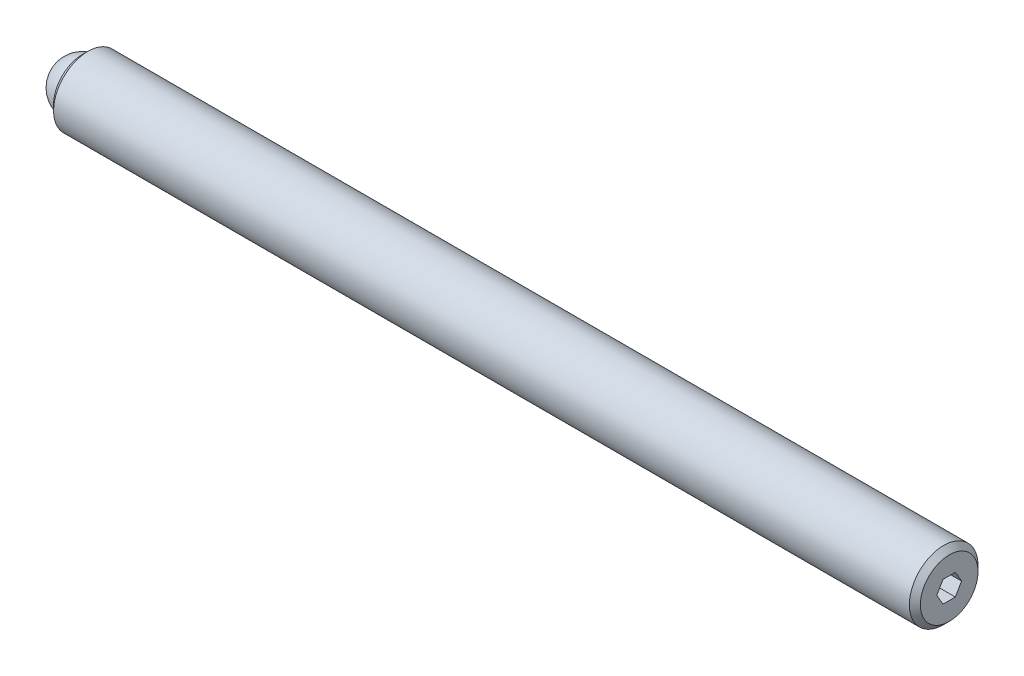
ISO-10303-21;
HEADER;
FILE_DESCRIPTION(('STEP AP214'),'2;1');
FILE_NAME('part.step','',(''),(''),'','','');
FILE_SCHEMA(('AUTOMOTIVE_DESIGN { 1 0 10303 214 1 1 1 1 }'));
ENDSEC;
DATA;
#1=APPLICATION_CONTEXT('core data for automotive mechanical design processes');
#2=APPLICATION_PROTOCOL_DEFINITION('international standard','automotive_design',2000,#1);
#3=PRODUCT_CONTEXT('',#1,'mechanical');
#4=PRODUCT('Part','Part','',(#3));
#5=PRODUCT_RELATED_PRODUCT_CATEGORY('part','',(#4));
#6=PRODUCT_DEFINITION_FORMATION('','',#4);
#7=PRODUCT_DEFINITION_CONTEXT('part definition',#1,'design');
#8=PRODUCT_DEFINITION('design','',#6,#7);
#9=PRODUCT_DEFINITION_SHAPE('','',#8);
#10=(LENGTH_UNIT() NAMED_UNIT(*) SI_UNIT(.MILLI.,.METRE.));
#11=(NAMED_UNIT(*) PLANE_ANGLE_UNIT() SI_UNIT($,.RADIAN.));
#12=(NAMED_UNIT(*) SI_UNIT($,.STERADIAN.) SOLID_ANGLE_UNIT());
#13=UNCERTAINTY_MEASURE_WITH_UNIT(LENGTH_MEASURE(1.E-05),#10,'distance_accuracy_value','');
#14=(GEOMETRIC_REPRESENTATION_CONTEXT(3) GLOBAL_UNCERTAINTY_ASSIGNED_CONTEXT((#13)) GLOBAL_UNIT_ASSIGNED_CONTEXT((#10,
#11,#12)) REPRESENTATION_CONTEXT('',''));
#15=CARTESIAN_POINT('',(0.,0.,0.));
#16=DIRECTION('',(0.,0.,1.));
#17=DIRECTION('',(1.,0.,0.));
#18=AXIS2_PLACEMENT_3D('',#15,#16,#17);
#19=CARTESIAN_POINT('',(0.,0.,0.));
#20=DIRECTION('',(0.,-1.,0.));
#21=DIRECTION('',(0.,0.,1.));
#22=AXIS2_PLACEMENT_3D('',#19,#20,#21);
#23=SPHERICAL_SURFACE('',#22,2.38125);
#24=CARTESIAN_POINT('',(0.,-2.38125,0.));
#25=VERTEX_POINT('',#24);
#26=VERTEX_LOOP('',#25);
#27=FACE_BOUND('',#26,.T.);
#28=ADVANCED_FACE('F41',(#27),#23,.T.);
#29=CLOSED_SHELL('',(#28));
#30=MANIFOLD_SOLID_BREP('B2',#29);
#31=CARTESIAN_POINT('',(80.16875,0.,0.));
#32=DIRECTION('',(-1.,0.,0.));
#33=DIRECTION('',(0.,0.,1.));
#34=AXIS2_PLACEMENT_3D('',#31,#32,#33);
#35=CYLINDRICAL_SURFACE('',#34,3.175);
#36=CARTESIAN_POINT('',(79.66075,0.,0.));
#37=DIRECTION('',(1.,0.,0.));
#38=DIRECTION('',(0.,0.,-1.));
#39=AXIS2_PLACEMENT_3D('',#36,#37,#38);
#40=CIRCLE('',#39,3.175);
#41=CARTESIAN_POINT('',(79.66075,0.,3.175));
#42=VERTEX_POINT('',#41);
#43=EDGE_CURVE('E39',#42,#42,#40,.F.);
#44=CARTESIAN_POINT('',(0.50800000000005,0.,0.));
#45=DIRECTION('',(1.,0.,0.));
#46=DIRECTION('',(0.,0.,-1.));
#47=AXIS2_PLACEMENT_3D('',#44,#45,#46);
#48=CIRCLE('',#47,3.175);
#49=CARTESIAN_POINT('',(0.508000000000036,0.,3.175));
#50=VERTEX_POINT('',#49);
#51=EDGE_CURVE('E157',#50,#50,#48,.T.);
#52=CARTESIAN_POINT('',(79.66075,0.,3.175));
#53=CARTESIAN_POINT('',(78.8362421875,0.,3.175));
#54=CARTESIAN_POINT('',(78.011734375,0.,3.175));
#55=CARTESIAN_POINT('',(76.36271875,0.,3.175));
#56=CARTESIAN_POINT('',(75.5382109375,0.,3.175));
#57=CARTESIAN_POINT('',(73.8891953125,0.,3.175));
#58=CARTESIAN_POINT('',(73.0646875,0.,3.175));
#59=CARTESIAN_POINT('',(71.415671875,0.,3.175));
#60=CARTESIAN_POINT('',(70.5911640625,0.,3.175));
#61=CARTESIAN_POINT('',(68.9421484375,0.,3.175));
#62=CARTESIAN_POINT('',(68.117640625,0.,3.175));
#63=CARTESIAN_POINT('',(66.468625,0.,3.175));
#64=CARTESIAN_POINT('',(65.6441171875,0.,3.175));
#65=CARTESIAN_POINT('',(63.9951015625,0.,3.175));
#66=CARTESIAN_POINT('',(63.17059375,0.,3.175));
#67=CARTESIAN_POINT('',(61.521578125,0.,3.175));
#68=CARTESIAN_POINT('',(60.6970703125,0.,3.175));
#69=CARTESIAN_POINT('',(59.0480546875,0.,3.175));
#70=CARTESIAN_POINT('',(58.223546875,0.,3.175));
#71=CARTESIAN_POINT('',(56.57453125,0.,3.175));
#72=CARTESIAN_POINT('',(55.7500234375,0.,3.175));
#73=CARTESIAN_POINT('',(54.1010078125,0.,3.175));
#74=CARTESIAN_POINT('',(53.2765,0.,3.175));
#75=CARTESIAN_POINT('',(51.627484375,0.,3.175));
#76=CARTESIAN_POINT('',(50.8029765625,0.,3.175));
#77=CARTESIAN_POINT('',(49.1539609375,0.,3.175));
#78=CARTESIAN_POINT('',(48.329453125,0.,3.175));
#79=CARTESIAN_POINT('',(46.6804375,0.,3.175));
#80=CARTESIAN_POINT('',(45.8559296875,0.,3.175));
#81=CARTESIAN_POINT('',(44.2069140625,0.,3.175));
#82=CARTESIAN_POINT('',(43.38240625,0.,3.175));
#83=CARTESIAN_POINT('',(41.733390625,0.,3.175));
#84=CARTESIAN_POINT('',(40.9088828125,0.,3.175));
#85=CARTESIAN_POINT('',(39.2598671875,0.,3.175));
#86=CARTESIAN_POINT('',(38.435359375,0.,3.175));
#87=CARTESIAN_POINT('',(36.78634375,0.,3.175));
#88=CARTESIAN_POINT('',(35.9618359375,0.,3.175));
#89=CARTESIAN_POINT('',(34.3128203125,0.,3.175));
#90=CARTESIAN_POINT('',(33.4883125,0.,3.175));
#91=CARTESIAN_POINT('',(31.839296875,0.,3.175));
#92=CARTESIAN_POINT('',(31.0147890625,0.,3.175));
#93=CARTESIAN_POINT('',(29.3657734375,0.,3.175));
#94=CARTESIAN_POINT('',(28.541265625,0.,3.175));
#95=CARTESIAN_POINT('',(26.89225,0.,3.175));
#96=CARTESIAN_POINT('',(26.0677421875,0.,3.175));
#97=CARTESIAN_POINT('',(24.4187265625,0.,3.175));
#98=CARTESIAN_POINT('',(23.59421875,0.,3.175));
#99=CARTESIAN_POINT('',(21.945203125,0.,3.175));
#100=CARTESIAN_POINT('',(21.1206953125,0.,3.175));
#101=CARTESIAN_POINT('',(19.4716796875,0.,3.175));
#102=CARTESIAN_POINT('',(18.647171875,0.,3.175));
#103=CARTESIAN_POINT('',(16.99815625,0.,3.175));
#104=CARTESIAN_POINT('',(16.1736484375,0.,3.175));
#105=CARTESIAN_POINT('',(14.5246328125,0.,3.175));
#106=CARTESIAN_POINT('',(13.700125,0.,3.175));
#107=CARTESIAN_POINT('',(12.051109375,0.,3.175));
#108=CARTESIAN_POINT('',(11.2266015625,0.,3.175));
#109=CARTESIAN_POINT('',(9.57758593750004,0.,3.175));
#110=CARTESIAN_POINT('',(8.75307812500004,0.,3.175));
#111=CARTESIAN_POINT('',(7.10406250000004,0.,3.175));
#112=CARTESIAN_POINT('',(6.27955468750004,0.,3.175));
#113=CARTESIAN_POINT('',(4.63053906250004,0.,3.175));
#114=CARTESIAN_POINT('',(3.80603125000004,0.,3.175));
#115=CARTESIAN_POINT('',(2.15701562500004,0.,3.175));
#116=CARTESIAN_POINT('',(1.33250781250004,0.,3.175));
#117=CARTESIAN_POINT('',(0.508000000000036,0.,3.175));
#118=B_SPLINE_CURVE_WITH_KNOTS('',3,(#52,#53,#54,#55,#56,#57,#58,#59,#60,#61,#62,#63,#64,#65,
#66,#67,#68,#69,#70,#71,#72,#73,#74,#75,#76,#77,#78,#79,#80,#81,#82,#83,#84,#85,#86,#87,#88,#89,
#90,#91,#92,#93,#94,#95,#96,#97,#98,#99,#100,#101,#102,#103,#104,#105,#106,#107,#108,#109,#110,
#111,#112,#113,#114,#115,#116,#117),.UNSPECIFIED.,.F.,.F.,(4,2,2,2,2,2,2,2,2,2,2,2,2,2,2,2,2,2,
2,2,2,2,2,2,2,2,2,2,2,2,2,2,4),(0.,2.47352343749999,4.94704687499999,7.42057031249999,
9.89409374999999,12.3676171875,14.841140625,17.3146640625,19.7881875,22.2617109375,24.735234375,
27.2087578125,29.68228125,32.1558046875,34.629328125,37.1028515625,39.576375,42.0498984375,
44.523421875,46.9969453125,49.47046875,51.9439921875,54.417515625,56.8910390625,59.3645625,
61.8380859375,64.311609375,66.7851328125,69.25865625,71.7321796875,74.205703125,76.6792265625,
79.15275),.UNSPECIFIED.);
#119=EDGE_CURVE('BSEAM54',#42,#50,#118,.T.);
#120=ORIENTED_EDGE('',*,*,#43,.T.);
#121=ORIENTED_EDGE('',*,*,#51,.T.);
#122=ORIENTED_EDGE('',*,*,#119,.T.);
#123=ORIENTED_EDGE('',*,*,#119,.F.);
#124=EDGE_LOOP('',(#120,#122,#121,#123));
#125=FACE_BOUND('',#124,.T.);
#126=ADVANCED_FACE('F54',(#125),#35,.T.);
#127=CARTESIAN_POINT('',(80.16875,0.,0.));
#128=DIRECTION('',(1.,0.,0.));
#129=DIRECTION('',(0.,0.,-1.));
#130=AXIS2_PLACEMENT_3D('',#127,#128,#129);
#131=PLANE('',#130);
#132=DIRECTION('',(0.,0.866025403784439,-0.5));
#133=VECTOR('',#132,1.);
#134=CARTESIAN_POINT('',(80.16875,-0.9921875,-0.572839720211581));
#135=LINE('',#134,#133);
#136=CARTESIAN_POINT('',(80.16875,-0.9921875,-0.572839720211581));
#137=VERTEX_POINT('',#136);
#138=CARTESIAN_POINT('',(80.16875,0.,-1.14567944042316));
#139=VERTEX_POINT('',#138);
#140=EDGE_CURVE('E69',#137,#139,#135,.T.);
#141=ORIENTED_EDGE('',*,*,#140,.F.);
#142=DIRECTION('',(0.,0.,-1.));
#143=VECTOR('',#142,1.);
#144=CARTESIAN_POINT('',(80.16875,-0.9921875,0.572839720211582));
#145=LINE('',#144,#143);
#146=CARTESIAN_POINT('',(80.16875,-0.9921875,0.572839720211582));
#147=VERTEX_POINT('',#146);
#148=EDGE_CURVE('E153',#147,#137,#145,.T.);
#149=ORIENTED_EDGE('',*,*,#148,.F.);
#150=DIRECTION('',(0.,-0.866025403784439,-0.5));
#151=VECTOR('',#150,1.);
#152=CARTESIAN_POINT('',(80.16875,0.,1.14567944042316));
#153=LINE('',#152,#151);
#154=CARTESIAN_POINT('',(80.16875,0.,1.14567944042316));
#155=VERTEX_POINT('',#154);
#156=EDGE_CURVE('E151',#155,#147,#153,.T.);
#157=ORIENTED_EDGE('',*,*,#156,.F.);
#158=DIRECTION('',(0.,-0.866025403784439,0.5));
#159=VECTOR('',#158,1.);
#160=CARTESIAN_POINT('',(80.16875,0.992187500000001,0.572839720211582));
#161=LINE('',#160,#159);
#162=CARTESIAN_POINT('',(80.16875,0.992187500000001,0.572839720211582));
#163=VERTEX_POINT('',#162);
#164=EDGE_CURVE('E117',#163,#155,#161,.T.);
#165=ORIENTED_EDGE('',*,*,#164,.F.);
#166=DIRECTION('',(0.,0.,1.));
#167=VECTOR('',#166,1.);
#168=CARTESIAN_POINT('',(80.16875,0.9921875,-0.572839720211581));
#169=LINE('',#168,#167);
#170=CARTESIAN_POINT('',(80.16875,0.9921875,-0.572839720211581));
#171=VERTEX_POINT('',#170);
#172=EDGE_CURVE('E147',#171,#163,#169,.T.);
#173=ORIENTED_EDGE('',*,*,#172,.F.);
#174=DIRECTION('',(0.,0.866025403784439,0.5));
#175=VECTOR('',#174,1.);
#176=CARTESIAN_POINT('',(80.16875,0.,-1.14567944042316));
#177=LINE('',#176,#175);
#178=EDGE_CURVE('E143',#139,#171,#177,.T.);
#179=ORIENTED_EDGE('',*,*,#178,.F.);
#180=EDGE_LOOP('',(#141,#149,#157,#165,#173,#179));
#181=FACE_BOUND('',#180,.T.);
#182=CARTESIAN_POINT('',(80.16875,0.,0.));
#183=DIRECTION('',(1.,0.,0.));
#184=DIRECTION('',(0.,0.,-1.));
#185=AXIS2_PLACEMENT_3D('',#182,#183,#184);
#186=CIRCLE('',#185,2.66700000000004);
#187=CARTESIAN_POINT('',(80.16875,0.,-2.66700000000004));
#188=VERTEX_POINT('',#187);
#189=EDGE_CURVE('E62',#188,#188,#186,.T.);
#190=ORIENTED_EDGE('',*,*,#189,.T.);
#191=EDGE_LOOP('',(#190));
#192=FACE_BOUND('',#191,.T.);
#193=ADVANCED_FACE('F170',(#181,#192),#131,.T.);
#194=CARTESIAN_POINT('',(0.,0.,0.));
#195=DIRECTION('',(1.,0.,0.));
#196=DIRECTION('',(0.,0.,-1.));
#197=AXIS2_PLACEMENT_3D('',#194,#195,#196);
#198=PLANE('',#197);
#199=CARTESIAN_POINT('',(0.,0.,0.));
#200=DIRECTION('',(-1.,0.,0.));
#201=DIRECTION('',(0.,0.,1.));
#202=AXIS2_PLACEMENT_3D('',#199,#200,#201);
#203=CIRCLE('',#202,2.38125);
#204=CARTESIAN_POINT('',(0.,0.,2.38125));
#205=VERTEX_POINT('',#204);
#206=EDGE_CURVE('E225',#205,#205,#203,.T.);
#207=ORIENTED_EDGE('',*,*,#206,.F.);
#208=EDGE_LOOP('',(#207));
#209=FACE_BOUND('',#208,.T.);
#210=CARTESIAN_POINT('',(0.,0.,0.));
#211=DIRECTION('',(1.,0.,0.));
#212=DIRECTION('',(0.,0.,-1.));
#213=AXIS2_PLACEMENT_3D('',#210,#211,#212);
#214=CIRCLE('',#213,2.66699999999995);
#215=CARTESIAN_POINT('',(0.,0.,-2.66699999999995));
#216=VERTEX_POINT('',#215);
#217=EDGE_CURVE('E165',#216,#216,#214,.F.);
#218=ORIENTED_EDGE('',*,*,#217,.T.);
#219=EDGE_LOOP('',(#218));
#220=FACE_BOUND('',#219,.T.);
#221=ADVANCED_FACE('F182',(#209,#220),#198,.F.);
#222=CARTESIAN_POINT('',(0.50800000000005,0.,0.));
#223=DIRECTION('',(1.,0.,0.));
#224=DIRECTION('',(0.,0.,-1.));
#225=AXIS2_PLACEMENT_3D('',#222,#223,#224);
#226=CONICAL_SURFACE('',#225,3.175,0.785398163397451);
#227=ORIENTED_EDGE('',*,*,#217,.F.);
#228=EDGE_LOOP('',(#227));
#229=FACE_BOUND('',#228,.T.);
#230=ORIENTED_EDGE('',*,*,#51,.F.);
#231=EDGE_LOOP('',(#230));
#232=FACE_BOUND('',#231,.T.);
#233=ADVANCED_FACE('F174',(#229,#232),#226,.T.);
#234=CARTESIAN_POINT('',(80.16875,0.,0.));
#235=DIRECTION('',(-1.,0.,0.));
#236=DIRECTION('',(0.,0.,1.));
#237=AXIS2_PLACEMENT_3D('',#234,#235,#236);
#238=CONICAL_SURFACE('',#237,2.66700000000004,0.785398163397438);
#239=ORIENTED_EDGE('',*,*,#43,.F.);
#240=EDGE_LOOP('',(#239));
#241=FACE_BOUND('',#240,.T.);
#242=ORIENTED_EDGE('',*,*,#189,.F.);
#243=EDGE_LOOP('',(#242));
#244=FACE_BOUND('',#243,.T.);
#245=ADVANCED_FACE('F56',(#241,#244),#238,.T.);
#246=CARTESIAN_POINT('',(77.88275,-0.9921875,-0.572839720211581));
#247=DIRECTION('',(0.,-0.5,-0.866025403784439));
#248=DIRECTION('',(0.,0.866025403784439,-0.5));
#249=AXIS2_PLACEMENT_3D('',#246,#247,#248);
#250=PLANE('',#249);
#251=ORIENTED_EDGE('',*,*,#140,.T.);
#252=DIRECTION('',(1.,0.,0.));
#253=VECTOR('',#252,1.);
#254=CARTESIAN_POINT('',(77.88275,0.,-1.14567944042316));
#255=LINE('',#254,#253);
#256=CARTESIAN_POINT('',(77.88275,0.,-1.14567944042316));
#257=VERTEX_POINT('',#256);
#258=EDGE_CURVE('E99',#257,#139,#255,.T.);
#259=ORIENTED_EDGE('',*,*,#258,.F.);
#260=DIRECTION('',(0.,0.866025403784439,-0.5));
#261=VECTOR('',#260,1.);
#262=CARTESIAN_POINT('',(77.88275,-0.9921875,-0.572839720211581));
#263=LINE('',#262,#261);
#264=CARTESIAN_POINT('',(77.88275,-0.9921875,-0.572839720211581));
#265=VERTEX_POINT('',#264);
#266=EDGE_CURVE('E155',#265,#257,#263,.T.);
#267=ORIENTED_EDGE('',*,*,#266,.F.);
#268=DIRECTION('',(1.,0.,0.));
#269=VECTOR('',#268,1.);
#270=CARTESIAN_POINT('',(77.88275,-0.9921875,-0.572839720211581));
#271=LINE('',#270,#269);
#272=EDGE_CURVE('E77',#265,#137,#271,.T.);
#273=ORIENTED_EDGE('',*,*,#272,.T.);
#274=EDGE_LOOP('',(#251,#259,#267,#273));
#275=FACE_BOUND('',#274,.T.);
#276=ADVANCED_FACE('F173',(#275),#250,.F.);
#277=CARTESIAN_POINT('',(77.88275,-0.9921875,0.572839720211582));
#278=DIRECTION('',(0.,-1.,0.));
#279=DIRECTION('',(0.,0.,-1.));
#280=AXIS2_PLACEMENT_3D('',#277,#278,#279);
#281=PLANE('',#280);
#282=ORIENTED_EDGE('',*,*,#148,.T.);
#283=ORIENTED_EDGE('',*,*,#272,.F.);
#284=DIRECTION('',(0.,0.,-1.));
#285=VECTOR('',#284,1.);
#286=CARTESIAN_POINT('',(77.88275,-0.9921875,0.572839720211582));
#287=LINE('',#286,#285);
#288=CARTESIAN_POINT('',(77.88275,-0.9921875,0.572839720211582));
#289=VERTEX_POINT('',#288);
#290=EDGE_CURVE('E129',#289,#265,#287,.T.);
#291=ORIENTED_EDGE('',*,*,#290,.F.);
#292=DIRECTION('',(1.,0.,0.));
#293=VECTOR('',#292,1.);
#294=CARTESIAN_POINT('',(77.88275,-0.9921875,0.572839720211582));
#295=LINE('',#294,#293);
#296=EDGE_CURVE('E121',#289,#147,#295,.T.);
#297=ORIENTED_EDGE('',*,*,#296,.T.);
#298=EDGE_LOOP('',(#282,#283,#291,#297));
#299=FACE_BOUND('',#298,.T.);
#300=ADVANCED_FACE('F180',(#299),#281,.F.);
#301=CARTESIAN_POINT('',(77.88275,0.,1.14567944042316));
#302=DIRECTION('',(0.,-0.5,0.866025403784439));
#303=DIRECTION('',(0.,-0.866025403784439,-0.5));
#304=AXIS2_PLACEMENT_3D('',#301,#302,#303);
#305=PLANE('',#304);
#306=ORIENTED_EDGE('',*,*,#156,.T.);
#307=ORIENTED_EDGE('',*,*,#296,.F.);
#308=DIRECTION('',(0.,-0.866025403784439,-0.5));
#309=VECTOR('',#308,1.);
#310=CARTESIAN_POINT('',(77.88275,0.,1.14567944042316));
#311=LINE('',#310,#309);
#312=CARTESIAN_POINT('',(77.88275,0.,1.14567944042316));
#313=VERTEX_POINT('',#312);
#314=EDGE_CURVE('E125',#313,#289,#311,.T.);
#315=ORIENTED_EDGE('',*,*,#314,.F.);
#316=DIRECTION('',(1.,0.,0.));
#317=VECTOR('',#316,1.);
#318=CARTESIAN_POINT('',(77.88275,0.,1.14567944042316));
#319=LINE('',#318,#317);
#320=EDGE_CURVE('E110',#313,#155,#319,.T.);
#321=ORIENTED_EDGE('',*,*,#320,.T.);
#322=EDGE_LOOP('',(#306,#307,#315,#321));
#323=FACE_BOUND('',#322,.T.);
#324=ADVANCED_FACE('F126',(#323),#305,.F.);
#325=CARTESIAN_POINT('',(77.88275,0.992187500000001,0.572839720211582));
#326=DIRECTION('',(0.,0.5,0.866025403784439));
#327=DIRECTION('',(0.,-0.866025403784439,0.5));
#328=AXIS2_PLACEMENT_3D('',#325,#326,#327);
#329=PLANE('',#328);
#330=ORIENTED_EDGE('',*,*,#164,.T.);
#331=ORIENTED_EDGE('',*,*,#320,.F.);
#332=DIRECTION('',(0.,-0.866025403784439,0.5));
#333=VECTOR('',#332,1.);
#334=CARTESIAN_POINT('',(77.88275,0.992187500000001,0.572839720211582));
#335=LINE('',#334,#333);
#336=CARTESIAN_POINT('',(77.88275,0.992187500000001,0.572839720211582));
#337=VERTEX_POINT('',#336);
#338=EDGE_CURVE('E114',#337,#313,#335,.T.);
#339=ORIENTED_EDGE('',*,*,#338,.F.);
#340=DIRECTION('',(1.,0.,0.));
#341=VECTOR('',#340,1.);
#342=CARTESIAN_POINT('',(77.88275,0.992187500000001,0.572839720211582));
#343=LINE('',#342,#341);
#344=EDGE_CURVE('E122',#337,#163,#343,.T.);
#345=ORIENTED_EDGE('',*,*,#344,.T.);
#346=EDGE_LOOP('',(#330,#331,#339,#345));
#347=FACE_BOUND('',#346,.T.);
#348=ADVANCED_FACE('F112',(#347),#329,.F.);
#349=CARTESIAN_POINT('',(77.88275,0.9921875,-0.572839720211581));
#350=DIRECTION('',(0.,1.,0.));
#351=DIRECTION('',(0.,0.,1.));
#352=AXIS2_PLACEMENT_3D('',#349,#350,#351);
#353=PLANE('',#352);
#354=ORIENTED_EDGE('',*,*,#172,.T.);
#355=ORIENTED_EDGE('',*,*,#344,.F.);
#356=DIRECTION('',(0.,0.,1.));
#357=VECTOR('',#356,1.);
#358=CARTESIAN_POINT('',(77.88275,0.9921875,-0.572839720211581));
#359=LINE('',#358,#357);
#360=CARTESIAN_POINT('',(77.88275,0.9921875,-0.572839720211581));
#361=VERTEX_POINT('',#360);
#362=EDGE_CURVE('E135',#361,#337,#359,.T.);
#363=ORIENTED_EDGE('',*,*,#362,.F.);
#364=DIRECTION('',(1.,0.,0.));
#365=VECTOR('',#364,1.);
#366=CARTESIAN_POINT('',(77.88275,0.9921875,-0.572839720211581));
#367=LINE('',#366,#365);
#368=EDGE_CURVE('E160',#361,#171,#367,.T.);
#369=ORIENTED_EDGE('',*,*,#368,.T.);
#370=EDGE_LOOP('',(#354,#355,#363,#369));
#371=FACE_BOUND('',#370,.T.);
#372=ADVANCED_FACE('F201',(#371),#353,.F.);
#373=CARTESIAN_POINT('',(77.88275,0.,-1.14567944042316));
#374=DIRECTION('',(0.,0.5,-0.866025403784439));
#375=DIRECTION('',(0.,0.866025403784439,0.5));
#376=AXIS2_PLACEMENT_3D('',#373,#374,#375);
#377=PLANE('',#376);
#378=ORIENTED_EDGE('',*,*,#178,.T.);
#379=ORIENTED_EDGE('',*,*,#368,.F.);
#380=DIRECTION('',(0.,0.866025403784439,0.5));
#381=VECTOR('',#380,1.);
#382=CARTESIAN_POINT('',(77.88275,0.,-1.14567944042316));
#383=LINE('',#382,#381);
#384=EDGE_CURVE('E137',#257,#361,#383,.T.);
#385=ORIENTED_EDGE('',*,*,#384,.F.);
#386=ORIENTED_EDGE('',*,*,#258,.T.);
#387=EDGE_LOOP('',(#378,#379,#385,#386));
#388=FACE_BOUND('',#387,.T.);
#389=ADVANCED_FACE('F198',(#388),#377,.F.);
#390=CARTESIAN_POINT('',(77.88275,0.,0.));
#391=DIRECTION('',(1.,0.,0.));
#392=DIRECTION('',(0.,0.,-1.));
#393=AXIS2_PLACEMENT_3D('',#390,#391,#392);
#394=PLANE('',#393);
#395=ORIENTED_EDGE('',*,*,#266,.T.);
#396=ORIENTED_EDGE('',*,*,#384,.T.);
#397=ORIENTED_EDGE('',*,*,#362,.T.);
#398=ORIENTED_EDGE('',*,*,#338,.T.);
#399=ORIENTED_EDGE('',*,*,#314,.T.);
#400=ORIENTED_EDGE('',*,*,#290,.T.);
#401=EDGE_LOOP('',(#395,#396,#397,#398,#399,#400));
#402=FACE_BOUND('',#401,.T.);
#403=ADVANCED_FACE('F132',(#402),#394,.T.);
#404=CARTESIAN_POINT('',(1.984375,0.,0.));
#405=DIRECTION('',(-1.,0.,0.));
#406=DIRECTION('',(0.,0.,1.));
#407=AXIS2_PLACEMENT_3D('',#404,#405,#406);
#408=CYLINDRICAL_SURFACE('',#407,2.38125);
#409=CARTESIAN_POINT('',(1.984375,0.,0.));
#410=DIRECTION('',(-1.,0.,0.));
#411=DIRECTION('',(0.,0.,1.));
#412=AXIS2_PLACEMENT_3D('',#409,#410,#411);
#413=CIRCLE('',#412,2.38125);
#414=CARTESIAN_POINT('',(1.984375,0.,2.38125));
#415=VERTEX_POINT('',#414);
#416=EDGE_CURVE('E144',#415,#415,#413,.T.);
#417=ORIENTED_EDGE('',*,*,#416,.F.);
#418=EDGE_LOOP('',(#417));
#419=FACE_BOUND('',#418,.T.);
#420=ORIENTED_EDGE('',*,*,#206,.T.);
#421=EDGE_LOOP('',(#420));
#422=FACE_BOUND('',#421,.T.);
#423=ADVANCED_FACE('F214',(#419,#422),#408,.F.);
#424=CARTESIAN_POINT('',(1.984375,0.,0.));
#425=DIRECTION('',(-1.,0.,0.));
#426=DIRECTION('',(0.,0.,1.));
#427=AXIS2_PLACEMENT_3D('',#424,#425,#426);
#428=PLANE('',#427);
#429=ORIENTED_EDGE('',*,*,#416,.T.);
#430=EDGE_LOOP('',(#429));
#431=FACE_BOUND('',#430,.T.);
#432=ADVANCED_FACE('F217',(#431),#428,.T.);
#433=CLOSED_SHELL('',(#126,#193,#221,#233,#245,#276,#300,#324,#348,#372,#389,#403,#423,#432));
#434=MANIFOLD_SOLID_BREP('B6',#433);
#435=ADVANCED_BREP_SHAPE_REPRESENTATION('',(#18,#30,#434),#14);
#436=SHAPE_DEFINITION_REPRESENTATION(#9,#435);
ENDSEC;
END-ISO-10303-21;
